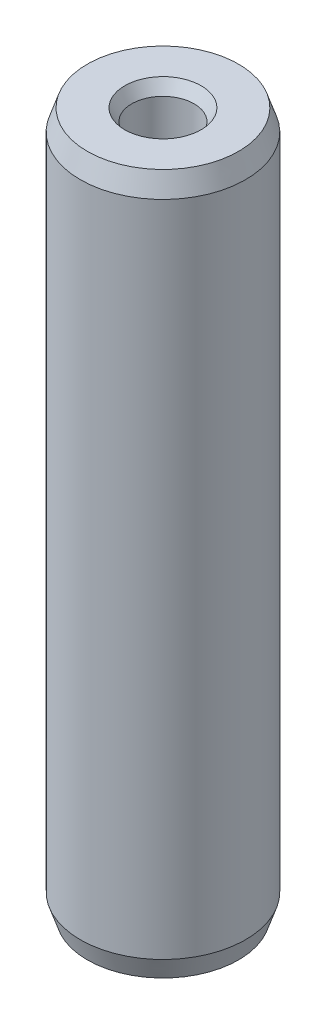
ISO-10303-21;
HEADER;
FILE_DESCRIPTION(('STEP AP214'),'2;1');
FILE_NAME('part.step','',(''),(''),'','','');
FILE_SCHEMA(('AUTOMOTIVE_DESIGN { 1 0 10303 214 1 1 1 1 }'));
ENDSEC;
DATA;
#1=APPLICATION_CONTEXT('core data for automotive mechanical design processes');
#2=APPLICATION_PROTOCOL_DEFINITION('international standard','automotive_design',2000,#1);
#3=PRODUCT_CONTEXT('',#1,'mechanical');
#4=PRODUCT('Part','Part','',(#3));
#5=PRODUCT_RELATED_PRODUCT_CATEGORY('part','',(#4));
#6=PRODUCT_DEFINITION_FORMATION('','',#4);
#7=PRODUCT_DEFINITION_CONTEXT('part definition',#1,'design');
#8=PRODUCT_DEFINITION('design','',#6,#7);
#9=PRODUCT_DEFINITION_SHAPE('','',#8);
#10=(LENGTH_UNIT() NAMED_UNIT(*) SI_UNIT(.MILLI.,.METRE.));
#11=(NAMED_UNIT(*) PLANE_ANGLE_UNIT() SI_UNIT($,.RADIAN.));
#12=(NAMED_UNIT(*) SI_UNIT($,.STERADIAN.) SOLID_ANGLE_UNIT());
#13=UNCERTAINTY_MEASURE_WITH_UNIT(LENGTH_MEASURE(1.E-05),#10,'distance_accuracy_value','');
#14=(GEOMETRIC_REPRESENTATION_CONTEXT(3) GLOBAL_UNCERTAINTY_ASSIGNED_CONTEXT((#13)) GLOBAL_UNIT_ASSIGNED_CONTEXT((#10,
#11,#12)) REPRESENTATION_CONTEXT('',''));
#15=CARTESIAN_POINT('',(0.,0.,0.));
#16=DIRECTION('',(0.,0.,1.));
#17=DIRECTION('',(1.,0.,0.));
#18=AXIS2_PLACEMENT_3D('',#15,#16,#17);
#19=CARTESIAN_POINT('',(-1.06592274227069,15.1859369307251,-1.12643595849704));
#20=DIRECTION('',(0.,-1.,0.));
#21=DIRECTION('',(0.,0.,-1.));
#22=AXIS2_PLACEMENT_3D('',#19,#20,#21);
#23=PLANE('',#22);
#24=CARTESIAN_POINT('',(-1.06592274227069,15.1859369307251,-1.12643595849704));
#25=DIRECTION('',(0.,-1.,0.));
#26=DIRECTION('',(0.,0.,-1.));
#27=AXIS2_PLACEMENT_3D('',#24,#25,#26);
#28=CIRCLE('',#27,1.3843);
#29=CARTESIAN_POINT('',(-1.06592274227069,15.1859369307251,0.257864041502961));
#30=VERTEX_POINT('',#29);
#31=EDGE_CURVE('E11',#30,#30,#28,.T.);
#32=ORIENTED_EDGE('',*,*,#31,.T.);
#33=EDGE_LOOP('',(#32));
#34=FACE_BOUND('',#33,.T.);
#35=CARTESIAN_POINT('',(-1.06592274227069,15.1859369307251,-1.12643595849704));
#36=DIRECTION('',(0.,1.,0.));
#37=DIRECTION('',(0.,0.,1.));
#38=AXIS2_PLACEMENT_3D('',#35,#36,#37);
#39=CIRCLE('',#38,2.7432);
#40=CARTESIAN_POINT('',(-1.06592274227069,15.1859369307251,1.61676404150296));
#41=VERTEX_POINT('',#40);
#42=EDGE_CURVE('E55',#41,#41,#39,.T.);
#43=ORIENTED_EDGE('',*,*,#42,.T.);
#44=EDGE_LOOP('',(#43));
#45=FACE_BOUND('',#44,.T.);
#46=ADVANCED_FACE('F17',(#34,#45),#23,.F.);
#47=CARTESIAN_POINT('',(-1.06592274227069,14.4239369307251,-1.12643595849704));
#48=DIRECTION('',(0.,-1.,0.));
#49=DIRECTION('',(0.,0.,-1.));
#50=AXIS2_PLACEMENT_3D('',#47,#48,#49);
#51=CONICAL_SURFACE('',#50,2.9972,0.321750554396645);
#52=ORIENTED_EDGE('',*,*,#42,.F.);
#53=EDGE_LOOP('',(#52));
#54=FACE_BOUND('',#53,.T.);
#55=CARTESIAN_POINT('',(-1.06592274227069,14.4239369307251,-1.12643595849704));
#56=DIRECTION('',(0.,1.,0.));
#57=DIRECTION('',(0.,0.,1.));
#58=AXIS2_PLACEMENT_3D('',#55,#56,#57);
#59=CIRCLE('',#58,2.9972);
#60=CARTESIAN_POINT('',(-1.06592274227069,14.4239369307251,1.87076404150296));
#61=VERTEX_POINT('',#60);
#62=EDGE_CURVE('E52',#61,#61,#59,.T.);
#63=ORIENTED_EDGE('',*,*,#62,.T.);
#64=EDGE_LOOP('',(#63));
#65=FACE_BOUND('',#64,.T.);
#66=ADVANCED_FACE('F76',(#54,#65),#51,.T.);
#67=CARTESIAN_POINT('',(-1.06592274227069,15.1859369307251,-1.12643595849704));
#68=DIRECTION('',(0.,1.,0.));
#69=DIRECTION('',(0.,0.,1.));
#70=AXIS2_PLACEMENT_3D('',#67,#68,#69);
#71=CYLINDRICAL_SURFACE('',#70,2.9972);
#72=ORIENTED_EDGE('',*,*,#62,.F.);
#73=EDGE_LOOP('',(#72));
#74=FACE_BOUND('',#73,.T.);
#75=CARTESIAN_POINT('',(-1.06592274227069,-9.45206306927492,-1.12643595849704));
#76=DIRECTION('',(0.,1.,0.));
#77=DIRECTION('',(0.,0.,1.));
#78=AXIS2_PLACEMENT_3D('',#75,#76,#77);
#79=CIRCLE('',#78,2.9972);
#80=CARTESIAN_POINT('',(-1.06592274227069,-9.45206306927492,1.87076404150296));
#81=VERTEX_POINT('',#80);
#82=EDGE_CURVE('E49',#81,#81,#79,.T.);
#83=ORIENTED_EDGE('',*,*,#82,.T.);
#84=EDGE_LOOP('',(#83));
#85=FACE_BOUND('',#84,.T.);
#86=ADVANCED_FACE('F82',(#74,#85),#71,.T.);
#87=CARTESIAN_POINT('',(-1.06592274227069,-10.2140630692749,-1.12643595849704));
#88=DIRECTION('',(0.,1.,0.));
#89=DIRECTION('',(0.,0.,1.));
#90=AXIS2_PLACEMENT_3D('',#87,#88,#89);
#91=CONICAL_SURFACE('',#90,2.7432,0.321750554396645);
#92=ORIENTED_EDGE('',*,*,#82,.F.);
#93=EDGE_LOOP('',(#92));
#94=FACE_BOUND('',#93,.T.);
#95=CARTESIAN_POINT('',(-1.06592274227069,-10.2140630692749,-1.12643595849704));
#96=DIRECTION('',(0.,1.,0.));
#97=DIRECTION('',(0.,0.,1.));
#98=AXIS2_PLACEMENT_3D('',#95,#96,#97);
#99=CIRCLE('',#98,2.7432);
#100=CARTESIAN_POINT('',(-1.06592274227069,-10.2140630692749,1.61676404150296));
#101=VERTEX_POINT('',#100);
#102=EDGE_CURVE('E44',#101,#101,#99,.T.);
#103=ORIENTED_EDGE('',*,*,#102,.T.);
#104=EDGE_LOOP('',(#103));
#105=FACE_BOUND('',#104,.T.);
#106=ADVANCED_FACE('F89',(#94,#105),#91,.T.);
#107=CARTESIAN_POINT('',(1.67727725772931,-10.2140630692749,-1.12643595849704));
#108=DIRECTION('',(0.,1.,0.));
#109=DIRECTION('',(0.,0.,1.));
#110=AXIS2_PLACEMENT_3D('',#107,#108,#109);
#111=PLANE('',#110);
#112=CARTESIAN_POINT('',(-1.06592274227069,-10.2140630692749,-1.12643595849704));
#113=DIRECTION('',(0.,1.,0.));
#114=DIRECTION('',(0.,0.,1.));
#115=AXIS2_PLACEMENT_3D('',#112,#113,#114);
#116=CIRCLE('',#115,1.3843);
#117=CARTESIAN_POINT('',(-1.06592274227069,-10.2140630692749,-2.51073595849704));
#118=VERTEX_POINT('',#117);
#119=EDGE_CURVE('E61',#118,#118,#116,.T.);
#120=ORIENTED_EDGE('',*,*,#119,.T.);
#121=EDGE_LOOP('',(#120));
#122=FACE_BOUND('',#121,.T.);
#123=ORIENTED_EDGE('',*,*,#102,.F.);
#124=EDGE_LOOP('',(#123));
#125=FACE_BOUND('',#124,.T.);
#126=ADVANCED_FACE('F93',(#122,#125),#111,.F.);
#127=CARTESIAN_POINT('',(-1.06592274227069,-10.2140630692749,-1.12643595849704));
#128=DIRECTION('',(0.,-1.,0.));
#129=DIRECTION('',(0.,0.,-1.));
#130=AXIS2_PLACEMENT_3D('',#127,#128,#129);
#131=CYLINDRICAL_SURFACE('',#130,1.1303);
#132=CARTESIAN_POINT('',(-1.06592274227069,-9.77412216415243,-1.12643595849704));
#133=DIRECTION('',(0.,1.,0.));
#134=DIRECTION('',(0.,0.,1.));
#135=AXIS2_PLACEMENT_3D('',#132,#133,#134);
#136=CIRCLE('',#135,1.1303);
#137=CARTESIAN_POINT('',(-1.06592274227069,-9.77412216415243,-2.25673595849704));
#138=VERTEX_POINT('',#137);
#139=EDGE_CURVE('E58',#138,#138,#136,.F.);
#140=ORIENTED_EDGE('',*,*,#139,.T.);
#141=EDGE_LOOP('',(#140));
#142=FACE_BOUND('',#141,.T.);
#143=CARTESIAN_POINT('',(-1.06592274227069,-4.49906306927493,-1.12643595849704));
#144=DIRECTION('',(0.,-1.,0.));
#145=DIRECTION('',(0.,0.,-1.));
#146=AXIS2_PLACEMENT_3D('',#143,#144,#145);
#147=CIRCLE('',#146,1.1303);
#148=CARTESIAN_POINT('',(-1.06592274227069,-4.49906306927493,-2.25673595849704));
#149=VERTEX_POINT('',#148);
#150=EDGE_CURVE('E41',#149,#149,#147,.T.);
#151=ORIENTED_EDGE('',*,*,#150,.F.);
#152=EDGE_LOOP('',(#151));
#153=FACE_BOUND('',#152,.T.);
#154=ADVANCED_FACE('F97',(#142,#153),#131,.F.);
#155=CARTESIAN_POINT('',(-1.06592274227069,-4.49906306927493,-1.12643595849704));
#156=DIRECTION('',(0.,-1.,0.));
#157=DIRECTION('',(0.,0.,-1.));
#158=AXIS2_PLACEMENT_3D('',#155,#156,#157);
#159=CONICAL_SURFACE('',#158,1.1303,1.02974425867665);
#160=CARTESIAN_POINT('',(-1.06592274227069,-3.81991031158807,-1.12643595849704));
#161=VERTEX_POINT('',#160);
#162=VERTEX_LOOP('',#161);
#163=FACE_BOUND('',#162,.T.);
#164=ORIENTED_EDGE('',*,*,#150,.T.);
#165=EDGE_LOOP('',(#164));
#166=FACE_BOUND('',#165,.T.);
#167=ADVANCED_FACE('F101',(#163,#166),#159,.F.);
#168=CARTESIAN_POINT('',(-1.06592274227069,15.1859369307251,-1.12643595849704));
#169=DIRECTION('',(0.,1.,0.));
#170=DIRECTION('',(0.,0.,1.));
#171=AXIS2_PLACEMENT_3D('',#168,#169,#170);
#172=CYLINDRICAL_SURFACE('',#171,1.1303);
#173=CARTESIAN_POINT('',(-1.06592274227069,14.7459960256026,-1.12643595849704));
#174=DIRECTION('',(0.,-1.,0.));
#175=DIRECTION('',(0.,0.,-1.));
#176=AXIS2_PLACEMENT_3D('',#173,#174,#175);
#177=CIRCLE('',#176,1.1303);
#178=CARTESIAN_POINT('',(-1.06592274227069,14.7459960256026,0.00386404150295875));
#179=VERTEX_POINT('',#178);
#180=EDGE_CURVE('E25',#179,#179,#177,.F.);
#181=ORIENTED_EDGE('',*,*,#180,.T.);
#182=EDGE_LOOP('',(#181));
#183=FACE_BOUND('',#182,.T.);
#184=CARTESIAN_POINT('',(-1.06592274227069,9.47093693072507,-1.12643595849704));
#185=DIRECTION('',(0.,1.,0.));
#186=DIRECTION('',(0.,0.,1.));
#187=AXIS2_PLACEMENT_3D('',#184,#185,#186);
#188=CIRCLE('',#187,1.1303);
#189=CARTESIAN_POINT('',(-1.06592274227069,9.47093693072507,0.00386404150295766));
#190=VERTEX_POINT('',#189);
#191=EDGE_CURVE('E39',#190,#190,#188,.T.);
#192=ORIENTED_EDGE('',*,*,#191,.F.);
#193=EDGE_LOOP('',(#192));
#194=FACE_BOUND('',#193,.T.);
#195=ADVANCED_FACE('F35',(#183,#194),#172,.F.);
#196=CARTESIAN_POINT('',(-1.06592274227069,9.47093693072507,-1.12643595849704));
#197=DIRECTION('',(0.,1.,0.));
#198=DIRECTION('',(0.,0.,1.));
#199=AXIS2_PLACEMENT_3D('',#196,#197,#198);
#200=CONICAL_SURFACE('',#199,1.1303,1.02974425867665);
#201=CARTESIAN_POINT('',(-1.06592274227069,8.79178417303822,-1.12643595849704));
#202=VERTEX_POINT('',#201);
#203=VERTEX_LOOP('',#202);
#204=FACE_BOUND('',#203,.T.);
#205=ORIENTED_EDGE('',*,*,#191,.T.);
#206=EDGE_LOOP('',(#205));
#207=FACE_BOUND('',#206,.T.);
#208=ADVANCED_FACE('F31',(#204,#207),#200,.F.);
#209=CARTESIAN_POINT('',(-1.06592274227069,-9.77412216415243,-1.12643595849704));
#210=DIRECTION('',(0.,-1.,0.));
#211=DIRECTION('',(0.,0.,-1.));
#212=AXIS2_PLACEMENT_3D('',#209,#210,#211);
#213=CONICAL_SURFACE('',#212,1.1303,0.5235987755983);
#214=CARTESIAN_POINT('',(-1.06592274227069,-10.2140630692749,-2.51073595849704));
#215=CARTESIAN_POINT('',(-1.06592274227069,-10.2094803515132,-2.50809012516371));
#216=CARTESIAN_POINT('',(-1.06592274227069,-10.2048976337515,-2.50544429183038));
#217=CARTESIAN_POINT('',(-1.06592274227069,-10.1957321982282,-2.50015262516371));
#218=CARTESIAN_POINT('',(-1.06592274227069,-10.1911494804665,-2.49750679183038));
#219=CARTESIAN_POINT('',(-1.06592274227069,-10.1819840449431,-2.49221512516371));
#220=CARTESIAN_POINT('',(-1.06592274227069,-10.1774013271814,-2.48956929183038));
#221=CARTESIAN_POINT('',(-1.06592274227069,-10.168235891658,-2.48427762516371));
#222=CARTESIAN_POINT('',(-1.06592274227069,-10.1636531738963,-2.48163179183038));
#223=CARTESIAN_POINT('',(-1.06592274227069,-10.1544877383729,-2.47634012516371));
#224=CARTESIAN_POINT('',(-1.06592274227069,-10.1499050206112,-2.47369429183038));
#225=CARTESIAN_POINT('',(-1.06592274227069,-10.1407395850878,-2.46840262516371));
#226=CARTESIAN_POINT('',(-1.06592274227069,-10.1361568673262,-2.46575679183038));
#227=CARTESIAN_POINT('',(-1.06592274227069,-10.1269914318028,-2.46046512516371));
#228=CARTESIAN_POINT('',(-1.06592274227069,-10.1224087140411,-2.45781929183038));
#229=CARTESIAN_POINT('',(-1.06592274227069,-10.1132432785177,-2.45252762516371));
#230=CARTESIAN_POINT('',(-1.06592274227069,-10.108660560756,-2.44988179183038));
#231=CARTESIAN_POINT('',(-1.06592274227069,-10.0994951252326,-2.44459012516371));
#232=CARTESIAN_POINT('',(-1.06592274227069,-10.0949124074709,-2.44194429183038));
#233=CARTESIAN_POINT('',(-1.06592274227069,-10.0857469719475,-2.43665262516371));
#234=CARTESIAN_POINT('',(-1.06592274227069,-10.0811642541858,-2.43400679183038));
#235=CARTESIAN_POINT('',(-1.06592274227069,-10.0719988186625,-2.42871512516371));
#236=CARTESIAN_POINT('',(-1.06592274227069,-10.0674161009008,-2.42606929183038));
#237=CARTESIAN_POINT('',(-1.06592274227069,-10.0582506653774,-2.42077762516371));
#238=CARTESIAN_POINT('',(-1.06592274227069,-10.0536679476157,-2.41813179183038));
#239=CARTESIAN_POINT('',(-1.06592274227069,-10.0445025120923,-2.41284012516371));
#240=CARTESIAN_POINT('',(-1.06592274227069,-10.0399197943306,-2.41019429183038));
#241=CARTESIAN_POINT('',(-1.06592274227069,-10.0307543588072,-2.40490262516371));
#242=CARTESIAN_POINT('',(-1.06592274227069,-10.0261716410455,-2.40225679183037));
#243=CARTESIAN_POINT('',(-1.06592274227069,-10.0170062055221,-2.39696512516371));
#244=CARTESIAN_POINT('',(-1.06592274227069,-10.0124234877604,-2.39431929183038));
#245=CARTESIAN_POINT('',(-1.06592274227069,-10.0032580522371,-2.38902762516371));
#246=CARTESIAN_POINT('',(-1.06592274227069,-9.99867533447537,-2.38638179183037));
#247=CARTESIAN_POINT('',(-1.06592274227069,-9.98950989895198,-2.38109012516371));
#248=CARTESIAN_POINT('',(-1.06592274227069,-9.98492718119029,-2.37844429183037));
#249=CARTESIAN_POINT('',(-1.06592274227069,-9.97576174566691,-2.37315262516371));
#250=CARTESIAN_POINT('',(-1.06592274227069,-9.97117902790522,-2.37050679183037));
#251=CARTESIAN_POINT('',(-1.06592274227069,-9.96201359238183,-2.36521512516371));
#252=CARTESIAN_POINT('',(-1.06592274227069,-9.95743087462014,-2.36256929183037));
#253=CARTESIAN_POINT('',(-1.06592274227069,-9.94826543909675,-2.35727762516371));
#254=CARTESIAN_POINT('',(-1.06592274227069,-9.94368272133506,-2.35463179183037));
#255=CARTESIAN_POINT('',(-1.06592274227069,-9.93451728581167,-2.34934012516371));
#256=CARTESIAN_POINT('',(-1.06592274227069,-9.92993456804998,-2.34669429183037));
#257=CARTESIAN_POINT('',(-1.06592274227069,-9.92076913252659,-2.34140262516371));
#258=CARTESIAN_POINT('',(-1.06592274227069,-9.9161864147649,-2.33875679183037));
#259=CARTESIAN_POINT('',(-1.06592274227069,-9.90702097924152,-2.33346512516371));
#260=CARTESIAN_POINT('',(-1.06592274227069,-9.90243826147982,-2.33081929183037));
#261=CARTESIAN_POINT('',(-1.06592274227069,-9.89327282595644,-2.32552762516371));
#262=CARTESIAN_POINT('',(-1.06592274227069,-9.88869010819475,-2.32288179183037));
#263=CARTESIAN_POINT('',(-1.06592274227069,-9.87952467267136,-2.31759012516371));
#264=CARTESIAN_POINT('',(-1.06592274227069,-9.87494195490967,-2.31494429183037));
#265=CARTESIAN_POINT('',(-1.06592274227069,-9.86577651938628,-2.30965262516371));
#266=CARTESIAN_POINT('',(-1.06592274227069,-9.86119380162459,-2.30700679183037));
#267=CARTESIAN_POINT('',(-1.06592274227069,-9.8520283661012,-2.30171512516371));
#268=CARTESIAN_POINT('',(-1.06592274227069,-9.84744564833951,-2.29906929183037));
#269=CARTESIAN_POINT('',(-1.06592274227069,-9.83828021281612,-2.29377762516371));
#270=CARTESIAN_POINT('',(-1.06592274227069,-9.83369749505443,-2.29113179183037));
#271=CARTESIAN_POINT('',(-1.06592274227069,-9.82453205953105,-2.28584012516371));
#272=CARTESIAN_POINT('',(-1.06592274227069,-9.81994934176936,-2.28319429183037));
#273=CARTESIAN_POINT('',(-1.06592274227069,-9.81078390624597,-2.27790262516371));
#274=CARTESIAN_POINT('',(-1.06592274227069,-9.80620118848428,-2.27525679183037));
#275=CARTESIAN_POINT('',(-1.06592274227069,-9.79703575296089,-2.26996512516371));
#276=CARTESIAN_POINT('',(-1.06592274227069,-9.7924530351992,-2.26731929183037));
#277=CARTESIAN_POINT('',(-1.06592274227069,-9.78328759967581,-2.26202762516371));
#278=CARTESIAN_POINT('',(-1.06592274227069,-9.77870488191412,-2.25938179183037));
#279=CARTESIAN_POINT('',(-1.06592274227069,-9.77412216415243,-2.25673595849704));
#280=B_SPLINE_CURVE_WITH_KNOTS('',3,(#214,#215,#216,#217,#218,#219,#220,#221,#222,#223,#224,
#225,#226,#227,#228,#229,#230,#231,#232,#233,#234,#235,#236,#237,#238,#239,#240,#241,#242,#243,
#244,#245,#246,#247,#248,#249,#250,#251,#252,#253,#254,#255,#256,#257,#258,#259,#260,#261,#262,
#263,#264,#265,#266,#267,#268,#269,#270,#271,#272,#273,#274,#275,#276,#277,#278,#279),
.UNSPECIFIED.,.F.,.F.,(4,2,2,2,2,2,2,2,2,2,2,2,2,2,2,2,2,2,2,2,2,2,2,2,2,2,2,2,2,2,2,2,4),(0.,
0.0158750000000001,0.0317500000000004,0.0476250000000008,0.0635000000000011,0.0793750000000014,
0.0952500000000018,0.111125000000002,0.127000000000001,0.142875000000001,0.158750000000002,
0.174625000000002,0.190500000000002,0.206375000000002,0.222250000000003,0.238125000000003,
0.254000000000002,0.269875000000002,0.285750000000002,0.301625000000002,0.317500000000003,
0.333375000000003,0.349250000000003,0.365125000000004,0.381000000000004,0.396875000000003,
0.412750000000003,0.428625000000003,0.444500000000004,0.460375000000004,0.476250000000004,
0.492125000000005,0.508000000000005),.UNSPECIFIED.);
#281=EDGE_CURVE('BSEAM34',#118,#138,#280,.T.);
#282=ORIENTED_EDGE('',*,*,#119,.F.);
#283=ORIENTED_EDGE('',*,*,#139,.F.);
#284=ORIENTED_EDGE('',*,*,#281,.T.);
#285=ORIENTED_EDGE('',*,*,#281,.F.);
#286=EDGE_LOOP('',(#282,#284,#283,#285));
#287=FACE_BOUND('',#286,.T.);
#288=ADVANCED_FACE('F34',(#287),#213,.F.);
#289=CARTESIAN_POINT('',(-1.06592274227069,14.7459960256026,-1.12643595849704));
#290=DIRECTION('',(0.,1.,0.));
#291=DIRECTION('',(0.,0.,1.));
#292=AXIS2_PLACEMENT_3D('',#289,#290,#291);
#293=CONICAL_SURFACE('',#292,1.1303,0.5235987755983);
#294=CARTESIAN_POINT('',(-1.06592274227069,15.1859369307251,0.257864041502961));
#295=CARTESIAN_POINT('',(-1.06592274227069,15.1813542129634,0.255218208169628));
#296=CARTESIAN_POINT('',(-1.06592274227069,15.1767714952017,0.252572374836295));
#297=CARTESIAN_POINT('',(-1.06592274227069,15.1676060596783,0.247280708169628));
#298=CARTESIAN_POINT('',(-1.06592274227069,15.1630233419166,0.244634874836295));
#299=CARTESIAN_POINT('',(-1.06592274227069,15.1538579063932,0.239343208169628));
#300=CARTESIAN_POINT('',(-1.06592274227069,15.1492751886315,0.236697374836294));
#301=CARTESIAN_POINT('',(-1.06592274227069,15.1401097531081,0.231405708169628));
#302=CARTESIAN_POINT('',(-1.06592274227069,15.1355270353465,0.228759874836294));
#303=CARTESIAN_POINT('',(-1.06592274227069,15.1263615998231,0.223468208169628));
#304=CARTESIAN_POINT('',(-1.06592274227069,15.1217788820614,0.220822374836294));
#305=CARTESIAN_POINT('',(-1.06592274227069,15.112613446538,0.215530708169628));
#306=CARTESIAN_POINT('',(-1.06592274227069,15.1080307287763,0.212884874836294));
#307=CARTESIAN_POINT('',(-1.06592274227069,15.0988652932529,0.207593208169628));
#308=CARTESIAN_POINT('',(-1.06592274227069,15.0942825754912,0.204947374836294));
#309=CARTESIAN_POINT('',(-1.06592274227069,15.0851171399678,0.199655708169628));
#310=CARTESIAN_POINT('',(-1.06592274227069,15.0805344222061,0.197009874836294));
#311=CARTESIAN_POINT('',(-1.06592274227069,15.0713689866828,0.191718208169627));
#312=CARTESIAN_POINT('',(-1.06592274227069,15.0667862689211,0.189072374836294));
#313=CARTESIAN_POINT('',(-1.06592274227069,15.0576208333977,0.183780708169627));
#314=CARTESIAN_POINT('',(-1.06592274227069,15.053038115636,0.181134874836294));
#315=CARTESIAN_POINT('',(-1.06592274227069,15.0438726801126,0.175843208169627));
#316=CARTESIAN_POINT('',(-1.06592274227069,15.0392899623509,0.173197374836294));
#317=CARTESIAN_POINT('',(-1.06592274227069,15.0301245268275,0.167905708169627));
#318=CARTESIAN_POINT('',(-1.06592274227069,15.0255418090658,0.165259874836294));
#319=CARTESIAN_POINT('',(-1.06592274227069,15.0163763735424,0.159968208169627));
#320=CARTESIAN_POINT('',(-1.06592274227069,15.0117936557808,0.157322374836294));
#321=CARTESIAN_POINT('',(-1.06592274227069,15.0026282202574,0.152030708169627));
#322=CARTESIAN_POINT('',(-1.06592274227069,14.9980455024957,0.149384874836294));
#323=CARTESIAN_POINT('',(-1.06592274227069,14.9888800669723,0.144093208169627));
#324=CARTESIAN_POINT('',(-1.06592274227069,14.9842973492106,0.141447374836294));
#325=CARTESIAN_POINT('',(-1.06592274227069,14.9751319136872,0.136155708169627));
#326=CARTESIAN_POINT('',(-1.06592274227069,14.9705491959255,0.133509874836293));
#327=CARTESIAN_POINT('',(-1.06592274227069,14.9613837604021,0.128218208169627));
#328=CARTESIAN_POINT('',(-1.06592274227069,14.9568010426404,0.125572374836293));
#329=CARTESIAN_POINT('',(-1.06592274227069,14.9476356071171,0.120280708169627));
#330=CARTESIAN_POINT('',(-1.06592274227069,14.9430528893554,0.117634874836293));
#331=CARTESIAN_POINT('',(-1.06592274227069,14.933887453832,0.112343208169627));
#332=CARTESIAN_POINT('',(-1.06592274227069,14.9293047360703,0.109697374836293));
#333=CARTESIAN_POINT('',(-1.06592274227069,14.9201393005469,0.104405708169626));
#334=CARTESIAN_POINT('',(-1.06592274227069,14.9155565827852,0.101759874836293));
#335=CARTESIAN_POINT('',(-1.06592274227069,14.9063911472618,0.0964682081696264));
#336=CARTESIAN_POINT('',(-1.06592274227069,14.9018084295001,0.0938223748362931));
#337=CARTESIAN_POINT('',(-1.06592274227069,14.8926429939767,0.0885307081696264));
#338=CARTESIAN_POINT('',(-1.06592274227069,14.8880602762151,0.085884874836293));
#339=CARTESIAN_POINT('',(-1.06592274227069,14.8788948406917,0.0805932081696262));
#340=CARTESIAN_POINT('',(-1.06592274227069,14.87431212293,0.0779473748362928));
#341=CARTESIAN_POINT('',(-1.06592274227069,14.8651466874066,0.0726557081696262));
#342=CARTESIAN_POINT('',(-1.06592274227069,14.8605639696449,0.0700098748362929));
#343=CARTESIAN_POINT('',(-1.06592274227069,14.8513985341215,0.0647182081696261));
#344=CARTESIAN_POINT('',(-1.06592274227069,14.8468158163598,0.0620723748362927));
#345=CARTESIAN_POINT('',(-1.06592274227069,14.8376503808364,0.056780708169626));
#346=CARTESIAN_POINT('',(-1.06592274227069,14.8330676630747,0.0541348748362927));
#347=CARTESIAN_POINT('',(-1.06592274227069,14.8239022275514,0.048843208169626));
#348=CARTESIAN_POINT('',(-1.06592274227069,14.8193195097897,0.0461973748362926));
#349=CARTESIAN_POINT('',(-1.06592274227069,14.8101540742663,0.0409057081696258));
#350=CARTESIAN_POINT('',(-1.06592274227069,14.8055713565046,0.0382598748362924));
#351=CARTESIAN_POINT('',(-1.06592274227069,14.7964059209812,0.0329682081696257));
#352=CARTESIAN_POINT('',(-1.06592274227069,14.7918232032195,0.0303223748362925));
#353=CARTESIAN_POINT('',(-1.06592274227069,14.7826577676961,0.0250307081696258));
#354=CARTESIAN_POINT('',(-1.06592274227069,14.7780750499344,0.0223848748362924));
#355=CARTESIAN_POINT('',(-1.06592274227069,14.768909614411,0.0170932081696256));
#356=CARTESIAN_POINT('',(-1.06592274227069,14.7643268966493,0.0144473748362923));
#357=CARTESIAN_POINT('',(-1.06592274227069,14.755161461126,0.0091557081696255));
#358=CARTESIAN_POINT('',(-1.06592274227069,14.7505787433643,0.00650987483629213));
#359=CARTESIAN_POINT('',(-1.06592274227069,14.7459960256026,0.00386404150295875));
#360=B_SPLINE_CURVE_WITH_KNOTS('',3,(#294,#295,#296,#297,#298,#299,#300,#301,#302,#303,#304,
#305,#306,#307,#308,#309,#310,#311,#312,#313,#314,#315,#316,#317,#318,#319,#320,#321,#322,#323,
#324,#325,#326,#327,#328,#329,#330,#331,#332,#333,#334,#335,#336,#337,#338,#339,#340,#341,#342,
#343,#344,#345,#346,#347,#348,#349,#350,#351,#352,#353,#354,#355,#356,#357,#358,#359),
.UNSPECIFIED.,.F.,.F.,(4,2,2,2,2,2,2,2,2,2,2,2,2,2,2,2,2,2,2,2,2,2,2,2,2,2,2,2,2,2,2,2,4),(0.,
0.0158750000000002,0.0317500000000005,0.0476250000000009,0.0635000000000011,0.0793750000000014,
0.0952500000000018,0.111125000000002,0.127000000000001,0.142875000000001,0.158750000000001,
0.174625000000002,0.190500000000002,0.206375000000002,0.222250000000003,0.238125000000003,
0.254000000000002,0.269875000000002,0.285750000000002,0.301625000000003,0.317500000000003,
0.333375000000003,0.349250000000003,0.365125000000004,0.381000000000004,0.396875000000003,
0.412750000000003,0.428625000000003,0.444500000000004,0.460375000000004,0.476250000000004,
0.492125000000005,0.508000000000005),.UNSPECIFIED.);
#361=EDGE_CURVE('BSEAM19',#30,#179,#360,.T.);
#362=ORIENTED_EDGE('',*,*,#31,.F.);
#363=ORIENTED_EDGE('',*,*,#180,.F.);
#364=ORIENTED_EDGE('',*,*,#361,.T.);
#365=ORIENTED_EDGE('',*,*,#361,.F.);
#366=EDGE_LOOP('',(#362,#364,#363,#365));
#367=FACE_BOUND('',#366,.T.);
#368=ADVANCED_FACE('F19',(#367),#293,.F.);
#369=CLOSED_SHELL('',(#46,#66,#86,#106,#126,#154,#167,#195,#208,#288,#368));
#370=MANIFOLD_SOLID_BREP('B1',#369);
#371=ADVANCED_BREP_SHAPE_REPRESENTATION('',(#18,#370),#14);
#372=SHAPE_DEFINITION_REPRESENTATION(#9,#371);
ENDSEC;
END-ISO-10303-21;
